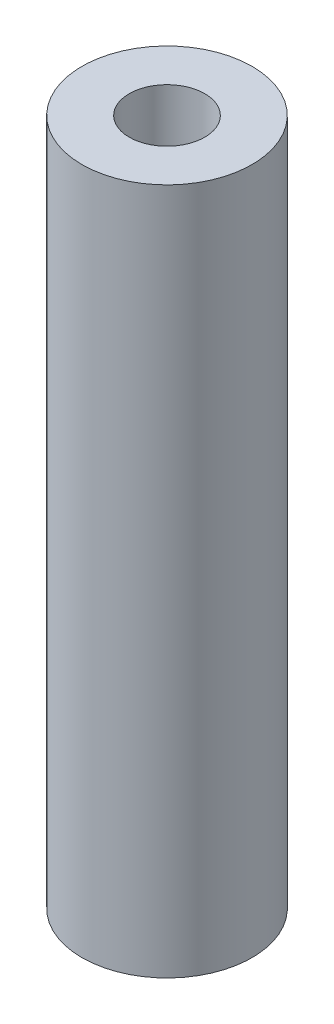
ISO-10303-21;
HEADER;
FILE_DESCRIPTION(('STEP AP214'),'2;1');
FILE_NAME('part.step','',(''),(''),'','','');
FILE_SCHEMA(('AUTOMOTIVE_DESIGN { 1 0 10303 214 1 1 1 1 }'));
ENDSEC;
DATA;
#1=APPLICATION_CONTEXT('core data for automotive mechanical design processes');
#2=APPLICATION_PROTOCOL_DEFINITION('international standard','automotive_design',2000,#1);
#3=PRODUCT_CONTEXT('',#1,'mechanical');
#4=PRODUCT('Part','Part','',(#3));
#5=PRODUCT_RELATED_PRODUCT_CATEGORY('part','',(#4));
#6=PRODUCT_DEFINITION_FORMATION('','',#4);
#7=PRODUCT_DEFINITION_CONTEXT('part definition',#1,'design');
#8=PRODUCT_DEFINITION('design','',#6,#7);
#9=PRODUCT_DEFINITION_SHAPE('','',#8);
#10=(LENGTH_UNIT() NAMED_UNIT(*) SI_UNIT(.MILLI.,.METRE.));
#11=(NAMED_UNIT(*) PLANE_ANGLE_UNIT() SI_UNIT($,.RADIAN.));
#12=(NAMED_UNIT(*) SI_UNIT($,.STERADIAN.) SOLID_ANGLE_UNIT());
#13=UNCERTAINTY_MEASURE_WITH_UNIT(LENGTH_MEASURE(1.E-05),#10,'distance_accuracy_value','');
#14=(GEOMETRIC_REPRESENTATION_CONTEXT(3) GLOBAL_UNCERTAINTY_ASSIGNED_CONTEXT((#13)) GLOBAL_UNIT_ASSIGNED_CONTEXT((#10,
#11,#12)) REPRESENTATION_CONTEXT('',''));
#15=CARTESIAN_POINT('',(0.,0.,0.));
#16=DIRECTION('',(0.,0.,1.));
#17=DIRECTION('',(1.,0.,0.));
#18=AXIS2_PLACEMENT_3D('',#15,#16,#17);
#19=CARTESIAN_POINT('',(0.,25.024999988,0.));
#20=DIRECTION('',(0.,1.,0.));
#21=DIRECTION('',(0.,0.,1.));
#22=AXIS2_PLACEMENT_3D('',#19,#20,#21);
#23=PLANE('',#22);
#24=CARTESIAN_POINT('',(0.,25.024999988,0.));
#25=DIRECTION('',(0.,1.,0.));
#26=DIRECTION('',(0.,0.,1.));
#27=AXIS2_PLACEMENT_3D('',#24,#25,#26);
#28=CIRCLE('',#27,3.1);
#29=CARTESIAN_POINT('',(0.,25.024999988,3.1));
#30=VERTEX_POINT('',#29);
#31=EDGE_CURVE('E10',#30,#30,#28,.T.);
#32=ORIENTED_EDGE('',*,*,#31,.T.);
#33=EDGE_LOOP('',(#32));
#34=FACE_BOUND('',#33,.T.);
#35=CARTESIAN_POINT('',(0.,25.024999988,0.));
#36=DIRECTION('',(0.,1.,0.));
#37=DIRECTION('',(0.,0.,1.));
#38=AXIS2_PLACEMENT_3D('',#35,#36,#37);
#39=CIRCLE('',#38,1.375);
#40=CARTESIAN_POINT('',(0.,25.024999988,1.375));
#41=VERTEX_POINT('',#40);
#42=EDGE_CURVE('E56',#41,#41,#39,.T.);
#43=ORIENTED_EDGE('',*,*,#42,.F.);
#44=EDGE_LOOP('',(#43));
#45=FACE_BOUND('',#44,.T.);
#46=ADVANCED_FACE('F43',(#34,#45),#23,.T.);
#47=CARTESIAN_POINT('',(0.,0.,0.));
#48=DIRECTION('',(0.,1.,0.));
#49=DIRECTION('',(0.,0.,1.));
#50=AXIS2_PLACEMENT_3D('',#47,#48,#49);
#51=PLANE('',#50);
#52=CARTESIAN_POINT('',(0.,0.,0.));
#53=DIRECTION('',(0.,1.,0.));
#54=DIRECTION('',(0.,0.,1.));
#55=AXIS2_PLACEMENT_3D('',#52,#53,#54);
#56=CIRCLE('',#55,3.1);
#57=CARTESIAN_POINT('',(0.,0.,3.1));
#58=VERTEX_POINT('',#57);
#59=EDGE_CURVE('E47',#58,#58,#56,.T.);
#60=ORIENTED_EDGE('',*,*,#59,.F.);
#61=EDGE_LOOP('',(#60));
#62=FACE_BOUND('',#61,.T.);
#63=CARTESIAN_POINT('',(0.,0.,0.));
#64=DIRECTION('',(0.,1.,0.));
#65=DIRECTION('',(0.,0.,1.));
#66=AXIS2_PLACEMENT_3D('',#63,#64,#65);
#67=CIRCLE('',#66,1.375);
#68=CARTESIAN_POINT('',(0.,0.,1.375));
#69=VERTEX_POINT('',#68);
#70=EDGE_CURVE('E58',#69,#69,#67,.T.);
#71=ORIENTED_EDGE('',*,*,#70,.T.);
#72=EDGE_LOOP('',(#71));
#73=FACE_BOUND('',#72,.T.);
#74=ADVANCED_FACE('F70',(#62,#73),#51,.F.);
#75=CARTESIAN_POINT('',(0.,25.024999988,0.));
#76=DIRECTION('',(0.,-1.,0.));
#77=DIRECTION('',(0.,0.,-1.));
#78=AXIS2_PLACEMENT_3D('',#75,#76,#77);
#79=CYLINDRICAL_SURFACE('',#78,3.1);
#80=ORIENTED_EDGE('',*,*,#31,.F.);
#81=EDGE_LOOP('',(#80));
#82=FACE_BOUND('',#81,.T.);
#83=ORIENTED_EDGE('',*,*,#59,.T.);
#84=EDGE_LOOP('',(#83));
#85=FACE_BOUND('',#84,.T.);
#86=ADVANCED_FACE('F45',(#82,#85),#79,.T.);
#87=CARTESIAN_POINT('',(0.,25.024999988,0.));
#88=DIRECTION('',(0.,-1.,0.));
#89=DIRECTION('',(0.,0.,-1.));
#90=AXIS2_PLACEMENT_3D('',#87,#88,#89);
#91=CYLINDRICAL_SURFACE('',#90,1.375);
#92=ORIENTED_EDGE('',*,*,#42,.T.);
#93=EDGE_LOOP('',(#92));
#94=FACE_BOUND('',#93,.T.);
#95=ORIENTED_EDGE('',*,*,#70,.F.);
#96=EDGE_LOOP('',(#95));
#97=FACE_BOUND('',#96,.T.);
#98=ADVANCED_FACE('F66',(#94,#97),#91,.F.);
#99=CLOSED_SHELL('',(#46,#74,#86,#98));
#100=MANIFOLD_SOLID_BREP('B2',#99);
#101=ADVANCED_BREP_SHAPE_REPRESENTATION('',(#18,#100),#14);
#102=SHAPE_DEFINITION_REPRESENTATION(#9,#101);
ENDSEC;
END-ISO-10303-21;
